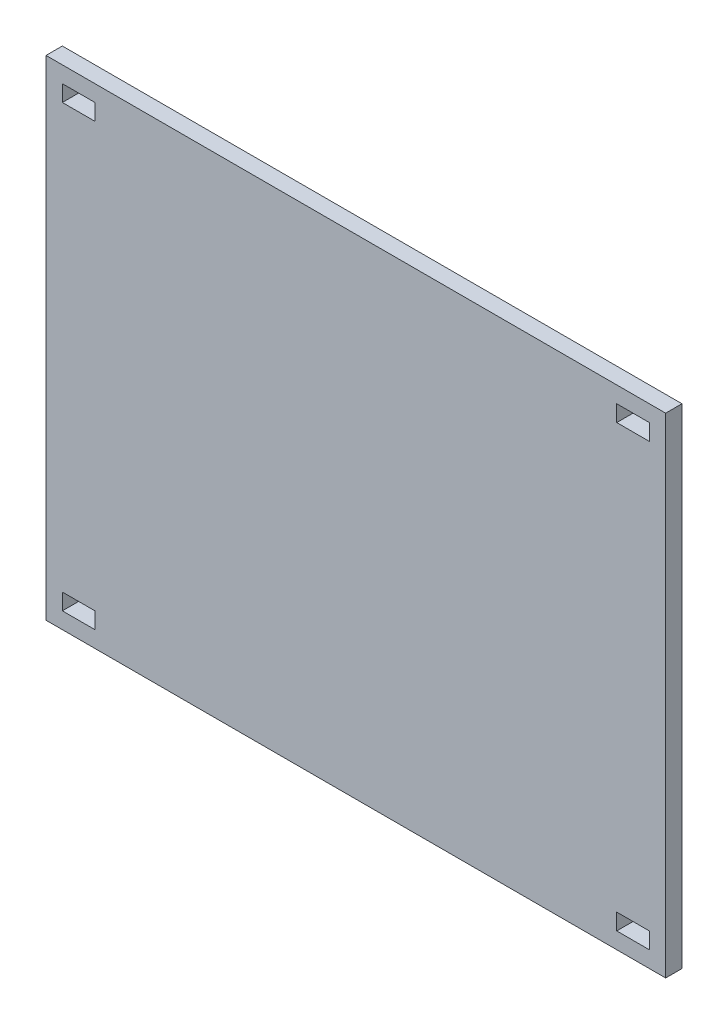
ISO-10303-21;
HEADER;
FILE_DESCRIPTION(('STEP AP214'),'2;1');
FILE_NAME('part.step','',(''),(''),'','','');
FILE_SCHEMA(('AUTOMOTIVE_DESIGN { 1 0 10303 214 1 1 1 1 }'));
ENDSEC;
DATA;
#1=APPLICATION_CONTEXT('core data for automotive mechanical design processes');
#2=APPLICATION_PROTOCOL_DEFINITION('international standard','automotive_design',2000,#1);
#3=PRODUCT_CONTEXT('',#1,'mechanical');
#4=PRODUCT('Part','Part','',(#3));
#5=PRODUCT_RELATED_PRODUCT_CATEGORY('part','',(#4));
#6=PRODUCT_DEFINITION_FORMATION('','',#4);
#7=PRODUCT_DEFINITION_CONTEXT('part definition',#1,'design');
#8=PRODUCT_DEFINITION('design','',#6,#7);
#9=PRODUCT_DEFINITION_SHAPE('','',#8);
#10=(LENGTH_UNIT() NAMED_UNIT(*) SI_UNIT(.MILLI.,.METRE.));
#11=(NAMED_UNIT(*) PLANE_ANGLE_UNIT() SI_UNIT($,.RADIAN.));
#12=(NAMED_UNIT(*) SI_UNIT($,.STERADIAN.) SOLID_ANGLE_UNIT());
#13=UNCERTAINTY_MEASURE_WITH_UNIT(LENGTH_MEASURE(1.E-05),#10,'distance_accuracy_value','');
#14=(GEOMETRIC_REPRESENTATION_CONTEXT(3) GLOBAL_UNCERTAINTY_ASSIGNED_CONTEXT((#13)) GLOBAL_UNIT_ASSIGNED_CONTEXT((#10,
#11,#12)) REPRESENTATION_CONTEXT('',''));
#15=CARTESIAN_POINT('',(0.,0.,0.));
#16=DIRECTION('',(0.,0.,1.));
#17=DIRECTION('',(1.,0.,0.));
#18=AXIS2_PLACEMENT_3D('',#15,#16,#17);
#19=CARTESIAN_POINT('',(0.,0.,3.175));
#20=DIRECTION('',(0.,0.,-1.));
#21=DIRECTION('',(-1.,0.,0.));
#22=AXIS2_PLACEMENT_3D('',#19,#20,#21);
#23=PLANE('',#22);
#24=DIRECTION('',(1.,0.,0.));
#25=VECTOR('',#24,1.);
#26=CARTESIAN_POINT('',(117.475,3.175,3.175));
#27=LINE('',#26,#25);
#28=CARTESIAN_POINT('',(111.125,3.175,3.175));
#29=VERTEX_POINT('',#28);
#30=CARTESIAN_POINT('',(117.475,3.175,3.175));
#31=VERTEX_POINT('',#30);
#32=EDGE_CURVE('E207',#29,#31,#27,.T.);
#33=ORIENTED_EDGE('',*,*,#32,.F.);
#34=DIRECTION('',(0.,-1.,0.));
#35=VECTOR('',#34,1.);
#36=CARTESIAN_POINT('',(111.125,3.175,3.175));
#37=LINE('',#36,#35);
#38=CARTESIAN_POINT('',(111.125,6.34999999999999,3.175));
#39=VERTEX_POINT('',#38);
#40=EDGE_CURVE('E215',#39,#29,#37,.T.);
#41=ORIENTED_EDGE('',*,*,#40,.F.);
#42=DIRECTION('',(-1.,0.,0.));
#43=VECTOR('',#42,1.);
#44=CARTESIAN_POINT('',(117.475,6.34999999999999,3.175));
#45=LINE('',#44,#43);
#46=CARTESIAN_POINT('',(117.475,6.34999999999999,3.175));
#47=VERTEX_POINT('',#46);
#48=EDGE_CURVE('E212',#47,#39,#45,.T.);
#49=ORIENTED_EDGE('',*,*,#48,.F.);
#50=DIRECTION('',(0.,1.,0.));
#51=VECTOR('',#50,1.);
#52=CARTESIAN_POINT('',(117.475,3.175,3.175));
#53=LINE('',#52,#51);
#54=EDGE_CURVE('E209',#31,#47,#53,.T.);
#55=ORIENTED_EDGE('',*,*,#54,.F.);
#56=EDGE_LOOP('',(#33,#41,#49,#55));
#57=FACE_BOUND('',#56,.T.);
#58=DIRECTION('',(0.,-1.,0.));
#59=VECTOR('',#58,1.);
#60=CARTESIAN_POINT('',(3.175,92.075,3.175));
#61=LINE('',#60,#59);
#62=CARTESIAN_POINT('',(3.175,92.075,3.175));
#63=VERTEX_POINT('',#62);
#64=CARTESIAN_POINT('',(3.175,88.9,3.175));
#65=VERTEX_POINT('',#64);
#66=EDGE_CURVE('E269',#63,#65,#61,.T.);
#67=ORIENTED_EDGE('',*,*,#66,.F.);
#68=DIRECTION('',(-1.,0.,0.));
#69=VECTOR('',#68,1.);
#70=CARTESIAN_POINT('',(3.175,92.075,3.175));
#71=LINE('',#70,#69);
#72=CARTESIAN_POINT('',(9.525,92.075,3.175));
#73=VERTEX_POINT('',#72);
#74=EDGE_CURVE('E277',#73,#63,#71,.T.);
#75=ORIENTED_EDGE('',*,*,#74,.F.);
#76=DIRECTION('',(0.,1.,0.));
#77=VECTOR('',#76,1.);
#78=CARTESIAN_POINT('',(9.525,92.075,3.175));
#79=LINE('',#78,#77);
#80=CARTESIAN_POINT('',(9.525,88.9,3.175));
#81=VERTEX_POINT('',#80);
#82=EDGE_CURVE('E274',#81,#73,#79,.T.);
#83=ORIENTED_EDGE('',*,*,#82,.F.);
#84=DIRECTION('',(1.,0.,0.));
#85=VECTOR('',#84,1.);
#86=CARTESIAN_POINT('',(3.175,88.9,3.175));
#87=LINE('',#86,#85);
#88=EDGE_CURVE('E271',#65,#81,#87,.T.);
#89=ORIENTED_EDGE('',*,*,#88,.F.);
#90=EDGE_LOOP('',(#67,#75,#83,#89));
#91=FACE_BOUND('',#90,.T.);
#92=DIRECTION('',(0.,-1.,0.));
#93=VECTOR('',#92,1.);
#94=CARTESIAN_POINT('',(0.,0.,3.175));
#95=LINE('',#94,#93);
#96=CARTESIAN_POINT('',(0.,95.25,3.175));
#97=VERTEX_POINT('',#96);
#98=CARTESIAN_POINT('',(0.,0.,3.175));
#99=VERTEX_POINT('',#98);
#100=EDGE_CURVE('E300',#97,#99,#95,.T.);
#101=ORIENTED_EDGE('',*,*,#100,.T.);
#102=DIRECTION('',(1.,0.,0.));
#103=VECTOR('',#102,1.);
#104=CARTESIAN_POINT('',(0.,0.,3.175));
#105=LINE('',#104,#103);
#106=CARTESIAN_POINT('',(120.65,0.,3.175));
#107=VERTEX_POINT('',#106);
#108=EDGE_CURVE('E303',#99,#107,#105,.T.);
#109=ORIENTED_EDGE('',*,*,#108,.T.);
#110=DIRECTION('',(0.,1.,0.));
#111=VECTOR('',#110,1.);
#112=CARTESIAN_POINT('',(120.65,0.,3.175));
#113=LINE('',#112,#111);
#114=CARTESIAN_POINT('',(120.65,95.25,3.175));
#115=VERTEX_POINT('',#114);
#116=EDGE_CURVE('E306',#107,#115,#113,.T.);
#117=ORIENTED_EDGE('',*,*,#116,.T.);
#118=DIRECTION('',(-1.,0.,0.));
#119=VECTOR('',#118,1.);
#120=CARTESIAN_POINT('',(0.,95.25,3.175));
#121=LINE('',#120,#119);
#122=EDGE_CURVE('E308',#115,#97,#121,.T.);
#123=ORIENTED_EDGE('',*,*,#122,.T.);
#124=EDGE_LOOP('',(#101,#109,#117,#123));
#125=FACE_BOUND('',#124,.T.);
#126=DIRECTION('',(1.,0.,0.));
#127=VECTOR('',#126,1.);
#128=CARTESIAN_POINT('',(3.175,3.175,3.175));
#129=LINE('',#128,#127);
#130=CARTESIAN_POINT('',(3.175,3.175,3.175));
#131=VERTEX_POINT('',#130);
#132=CARTESIAN_POINT('',(9.52499999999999,3.175,3.175));
#133=VERTEX_POINT('',#132);
#134=EDGE_CURVE('E238',#131,#133,#129,.T.);
#135=ORIENTED_EDGE('',*,*,#134,.F.);
#136=DIRECTION('',(0.,-1.,0.));
#137=VECTOR('',#136,1.);
#138=CARTESIAN_POINT('',(3.175,3.175,3.175));
#139=LINE('',#138,#137);
#140=CARTESIAN_POINT('',(3.175,6.34999999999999,3.175));
#141=VERTEX_POINT('',#140);
#142=EDGE_CURVE('E246',#141,#131,#139,.T.);
#143=ORIENTED_EDGE('',*,*,#142,.F.);
#144=DIRECTION('',(-1.,0.,0.));
#145=VECTOR('',#144,1.);
#146=CARTESIAN_POINT('',(3.175,6.34999999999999,3.175));
#147=LINE('',#146,#145);
#148=CARTESIAN_POINT('',(9.52499999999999,6.34999999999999,3.175));
#149=VERTEX_POINT('',#148);
#150=EDGE_CURVE('E243',#149,#141,#147,.T.);
#151=ORIENTED_EDGE('',*,*,#150,.F.);
#152=DIRECTION('',(0.,1.,0.));
#153=VECTOR('',#152,1.);
#154=CARTESIAN_POINT('',(9.52499999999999,3.175,3.175));
#155=LINE('',#154,#153);
#156=EDGE_CURVE('E240',#133,#149,#155,.T.);
#157=ORIENTED_EDGE('',*,*,#156,.F.);
#158=EDGE_LOOP('',(#135,#143,#151,#157));
#159=FACE_BOUND('',#158,.T.);
#160=DIRECTION('',(-1.,0.,0.));
#161=VECTOR('',#160,1.);
#162=CARTESIAN_POINT('',(117.475,92.075,3.175));
#163=LINE('',#162,#161);
#164=CARTESIAN_POINT('',(117.475,92.075,3.175));
#165=VERTEX_POINT('',#164);
#166=CARTESIAN_POINT('',(111.125,92.075,3.175));
#167=VERTEX_POINT('',#166);
#168=EDGE_CURVE('E171',#165,#167,#163,.T.);
#169=ORIENTED_EDGE('',*,*,#168,.F.);
#170=DIRECTION('',(0.,1.,0.));
#171=VECTOR('',#170,1.);
#172=CARTESIAN_POINT('',(117.475,92.075,3.175));
#173=LINE('',#172,#171);
#174=CARTESIAN_POINT('',(117.475,88.9,3.175));
#175=VERTEX_POINT('',#174);
#176=EDGE_CURVE('E193',#175,#165,#173,.T.);
#177=ORIENTED_EDGE('',*,*,#176,.F.);
#178=DIRECTION('',(1.,0.,0.));
#179=VECTOR('',#178,1.);
#180=CARTESIAN_POINT('',(117.475,88.9,3.175));
#181=LINE('',#180,#179);
#182=CARTESIAN_POINT('',(111.125,88.9,3.175));
#183=VERTEX_POINT('',#182);
#184=EDGE_CURVE('E191',#183,#175,#181,.T.);
#185=ORIENTED_EDGE('',*,*,#184,.F.);
#186=DIRECTION('',(0.,-1.,0.));
#187=VECTOR('',#186,1.);
#188=CARTESIAN_POINT('',(111.125,92.075,3.175));
#189=LINE('',#188,#187);
#190=EDGE_CURVE('E179',#167,#183,#189,.T.);
#191=ORIENTED_EDGE('',*,*,#190,.F.);
#192=EDGE_LOOP('',(#169,#177,#185,#191));
#193=FACE_BOUND('',#192,.T.);
#194=ADVANCED_FACE('F34',(#57,#91,#125,#159,#193),#23,.F.);
#195=CARTESIAN_POINT('',(0.,0.,0.));
#196=DIRECTION('',(0.,0.,-1.));
#197=DIRECTION('',(-1.,0.,0.));
#198=AXIS2_PLACEMENT_3D('',#195,#196,#197);
#199=PLANE('',#198);
#200=DIRECTION('',(0.,-1.,0.));
#201=VECTOR('',#200,1.);
#202=CARTESIAN_POINT('',(111.125,3.175,0.));
#203=LINE('',#202,#201);
#204=CARTESIAN_POINT('',(111.125,6.34999999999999,0.));
#205=VERTEX_POINT('',#204);
#206=CARTESIAN_POINT('',(111.125,3.175,0.));
#207=VERTEX_POINT('',#206);
#208=EDGE_CURVE('E210',#205,#207,#203,.T.);
#209=ORIENTED_EDGE('',*,*,#208,.T.);
#210=DIRECTION('',(1.,0.,0.));
#211=VECTOR('',#210,1.);
#212=CARTESIAN_POINT('',(117.475,3.175,0.));
#213=LINE('',#212,#211);
#214=CARTESIAN_POINT('',(117.475,3.175,0.));
#215=VERTEX_POINT('',#214);
#216=EDGE_CURVE('E187',#207,#215,#213,.T.);
#217=ORIENTED_EDGE('',*,*,#216,.T.);
#218=DIRECTION('',(0.,1.,0.));
#219=VECTOR('',#218,1.);
#220=CARTESIAN_POINT('',(117.475,3.175,0.));
#221=LINE('',#220,#219);
#222=CARTESIAN_POINT('',(117.475,6.34999999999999,0.));
#223=VERTEX_POINT('',#222);
#224=EDGE_CURVE('E220',#215,#223,#221,.T.);
#225=ORIENTED_EDGE('',*,*,#224,.T.);
#226=DIRECTION('',(-1.,0.,0.));
#227=VECTOR('',#226,1.);
#228=CARTESIAN_POINT('',(117.475,6.34999999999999,0.));
#229=LINE('',#228,#227);
#230=EDGE_CURVE('E223',#223,#205,#229,.T.);
#231=ORIENTED_EDGE('',*,*,#230,.T.);
#232=EDGE_LOOP('',(#209,#217,#225,#231));
#233=FACE_BOUND('',#232,.T.);
#234=DIRECTION('',(-1.,0.,0.));
#235=VECTOR('',#234,1.);
#236=CARTESIAN_POINT('',(3.175,92.075,0.));
#237=LINE('',#236,#235);
#238=CARTESIAN_POINT('',(9.525,92.075,0.));
#239=VERTEX_POINT('',#238);
#240=CARTESIAN_POINT('',(3.175,92.075,0.));
#241=VERTEX_POINT('',#240);
#242=EDGE_CURVE('E272',#239,#241,#237,.T.);
#243=ORIENTED_EDGE('',*,*,#242,.T.);
#244=DIRECTION('',(0.,-1.,0.));
#245=VECTOR('',#244,1.);
#246=CARTESIAN_POINT('',(3.175,92.075,0.));
#247=LINE('',#246,#245);
#248=CARTESIAN_POINT('',(3.175,88.9,0.));
#249=VERTEX_POINT('',#248);
#250=EDGE_CURVE('E268',#241,#249,#247,.T.);
#251=ORIENTED_EDGE('',*,*,#250,.T.);
#252=DIRECTION('',(1.,0.,0.));
#253=VECTOR('',#252,1.);
#254=CARTESIAN_POINT('',(3.175,88.9,0.));
#255=LINE('',#254,#253);
#256=CARTESIAN_POINT('',(9.525,88.9,0.));
#257=VERTEX_POINT('',#256);
#258=EDGE_CURVE('E282',#249,#257,#255,.T.);
#259=ORIENTED_EDGE('',*,*,#258,.T.);
#260=DIRECTION('',(0.,1.,0.));
#261=VECTOR('',#260,1.);
#262=CARTESIAN_POINT('',(9.525,92.075,0.));
#263=LINE('',#262,#261);
#264=EDGE_CURVE('E285',#257,#239,#263,.T.);
#265=ORIENTED_EDGE('',*,*,#264,.T.);
#266=EDGE_LOOP('',(#243,#251,#259,#265));
#267=FACE_BOUND('',#266,.T.);
#268=DIRECTION('',(0.,-1.,0.));
#269=VECTOR('',#268,1.);
#270=CARTESIAN_POINT('',(0.,0.,0.));
#271=LINE('',#270,#269);
#272=CARTESIAN_POINT('',(0.,95.25,0.));
#273=VERTEX_POINT('',#272);
#274=CARTESIAN_POINT('',(0.,0.,0.));
#275=VERTEX_POINT('',#274);
#276=EDGE_CURVE('E299',#273,#275,#271,.T.);
#277=ORIENTED_EDGE('',*,*,#276,.F.);
#278=DIRECTION('',(-1.,0.,0.));
#279=VECTOR('',#278,1.);
#280=CARTESIAN_POINT('',(0.,95.25,0.));
#281=LINE('',#280,#279);
#282=CARTESIAN_POINT('',(120.65,95.25,0.));
#283=VERTEX_POINT('',#282);
#284=EDGE_CURVE('E304',#283,#273,#281,.T.);
#285=ORIENTED_EDGE('',*,*,#284,.F.);
#286=DIRECTION('',(0.,1.,0.));
#287=VECTOR('',#286,1.);
#288=CARTESIAN_POINT('',(120.65,0.,0.));
#289=LINE('',#288,#287);
#290=CARTESIAN_POINT('',(120.65,0.,0.));
#291=VERTEX_POINT('',#290);
#292=EDGE_CURVE('E315',#291,#283,#289,.T.);
#293=ORIENTED_EDGE('',*,*,#292,.F.);
#294=DIRECTION('',(1.,0.,0.));
#295=VECTOR('',#294,1.);
#296=CARTESIAN_POINT('',(0.,0.,0.));
#297=LINE('',#296,#295);
#298=EDGE_CURVE('E313',#275,#291,#297,.T.);
#299=ORIENTED_EDGE('',*,*,#298,.F.);
#300=EDGE_LOOP('',(#277,#285,#293,#299));
#301=FACE_BOUND('',#300,.T.);
#302=DIRECTION('',(0.,-1.,0.));
#303=VECTOR('',#302,1.);
#304=CARTESIAN_POINT('',(3.175,3.175,0.));
#305=LINE('',#304,#303);
#306=CARTESIAN_POINT('',(3.175,6.34999999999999,0.));
#307=VERTEX_POINT('',#306);
#308=CARTESIAN_POINT('',(3.175,3.175,0.));
#309=VERTEX_POINT('',#308);
#310=EDGE_CURVE('E241',#307,#309,#305,.T.);
#311=ORIENTED_EDGE('',*,*,#310,.T.);
#312=DIRECTION('',(1.,0.,0.));
#313=VECTOR('',#312,1.);
#314=CARTESIAN_POINT('',(3.175,3.175,0.));
#315=LINE('',#314,#313);
#316=CARTESIAN_POINT('',(9.52499999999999,3.175,0.));
#317=VERTEX_POINT('',#316);
#318=EDGE_CURVE('E237',#309,#317,#315,.T.);
#319=ORIENTED_EDGE('',*,*,#318,.T.);
#320=DIRECTION('',(0.,1.,0.));
#321=VECTOR('',#320,1.);
#322=CARTESIAN_POINT('',(9.52499999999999,3.175,0.));
#323=LINE('',#322,#321);
#324=CARTESIAN_POINT('',(9.52499999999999,6.34999999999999,0.));
#325=VERTEX_POINT('',#324);
#326=EDGE_CURVE('E251',#317,#325,#323,.T.);
#327=ORIENTED_EDGE('',*,*,#326,.T.);
#328=DIRECTION('',(-1.,0.,0.));
#329=VECTOR('',#328,1.);
#330=CARTESIAN_POINT('',(3.175,6.34999999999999,0.));
#331=LINE('',#330,#329);
#332=EDGE_CURVE('E254',#325,#307,#331,.T.);
#333=ORIENTED_EDGE('',*,*,#332,.T.);
#334=EDGE_LOOP('',(#311,#319,#327,#333));
#335=FACE_BOUND('',#334,.T.);
#336=DIRECTION('',(0.,1.,0.));
#337=VECTOR('',#336,1.);
#338=CARTESIAN_POINT('',(117.475,92.075,0.));
#339=LINE('',#338,#337);
#340=CARTESIAN_POINT('',(117.475,88.9,0.));
#341=VERTEX_POINT('',#340);
#342=CARTESIAN_POINT('',(117.475,92.075,0.));
#343=VERTEX_POINT('',#342);
#344=EDGE_CURVE('E180',#341,#343,#339,.T.);
#345=ORIENTED_EDGE('',*,*,#344,.T.);
#346=DIRECTION('',(-1.,0.,0.));
#347=VECTOR('',#346,1.);
#348=CARTESIAN_POINT('',(117.475,92.075,0.));
#349=LINE('',#348,#347);
#350=CARTESIAN_POINT('',(111.125,92.075,0.));
#351=VERTEX_POINT('',#350);
#352=EDGE_CURVE('E57',#343,#351,#349,.T.);
#353=ORIENTED_EDGE('',*,*,#352,.T.);
#354=DIRECTION('',(0.,-1.,0.));
#355=VECTOR('',#354,1.);
#356=CARTESIAN_POINT('',(111.125,92.075,0.));
#357=LINE('',#356,#355);
#358=CARTESIAN_POINT('',(111.125,88.9,0.));
#359=VERTEX_POINT('',#358);
#360=EDGE_CURVE('E186',#351,#359,#357,.T.);
#361=ORIENTED_EDGE('',*,*,#360,.T.);
#362=DIRECTION('',(1.,0.,0.));
#363=VECTOR('',#362,1.);
#364=CARTESIAN_POINT('',(117.475,88.9,0.));
#365=LINE('',#364,#363);
#366=EDGE_CURVE('E199',#359,#341,#365,.T.);
#367=ORIENTED_EDGE('',*,*,#366,.T.);
#368=EDGE_LOOP('',(#345,#353,#361,#367));
#369=FACE_BOUND('',#368,.T.);
#370=ADVANCED_FACE('F333',(#233,#267,#301,#335,#369),#199,.T.);
#371=CARTESIAN_POINT('',(0.,0.,3.175));
#372=DIRECTION('',(1.,0.,0.));
#373=DIRECTION('',(0.,0.,-1.));
#374=AXIS2_PLACEMENT_3D('',#371,#372,#373);
#375=PLANE('',#374);
#376=ORIENTED_EDGE('',*,*,#276,.T.);
#377=DIRECTION('',(0.,0.,-1.));
#378=VECTOR('',#377,1.);
#379=CARTESIAN_POINT('',(0.,0.,3.175));
#380=LINE('',#379,#378);
#381=EDGE_CURVE('E11',#99,#275,#380,.T.);
#382=ORIENTED_EDGE('',*,*,#381,.F.);
#383=ORIENTED_EDGE('',*,*,#100,.F.);
#384=DIRECTION('',(0.,0.,-1.));
#385=VECTOR('',#384,1.);
#386=CARTESIAN_POINT('',(0.,95.25,3.175));
#387=LINE('',#386,#385);
#388=EDGE_CURVE('E310',#97,#273,#387,.T.);
#389=ORIENTED_EDGE('',*,*,#388,.T.);
#390=EDGE_LOOP('',(#376,#382,#383,#389));
#391=FACE_BOUND('',#390,.T.);
#392=ADVANCED_FACE('F36',(#391),#375,.F.);
#393=CARTESIAN_POINT('',(0.,0.,3.175));
#394=DIRECTION('',(0.,1.,0.));
#395=DIRECTION('',(0.,0.,1.));
#396=AXIS2_PLACEMENT_3D('',#393,#394,#395);
#397=PLANE('',#396);
#398=ORIENTED_EDGE('',*,*,#298,.T.);
#399=DIRECTION('',(0.,0.,-1.));
#400=VECTOR('',#399,1.);
#401=CARTESIAN_POINT('',(120.65,0.,3.175));
#402=LINE('',#401,#400);
#403=EDGE_CURVE('E42',#107,#291,#402,.T.);
#404=ORIENTED_EDGE('',*,*,#403,.F.);
#405=ORIENTED_EDGE('',*,*,#108,.F.);
#406=ORIENTED_EDGE('',*,*,#381,.T.);
#407=EDGE_LOOP('',(#398,#404,#405,#406));
#408=FACE_BOUND('',#407,.T.);
#409=ADVANCED_FACE('F344',(#408),#397,.F.);
#410=CARTESIAN_POINT('',(120.65,0.,3.175));
#411=DIRECTION('',(-1.,0.,0.));
#412=DIRECTION('',(0.,0.,1.));
#413=AXIS2_PLACEMENT_3D('',#410,#411,#412);
#414=PLANE('',#413);
#415=ORIENTED_EDGE('',*,*,#292,.T.);
#416=DIRECTION('',(0.,0.,-1.));
#417=VECTOR('',#416,1.);
#418=CARTESIAN_POINT('',(120.65,95.25,3.175));
#419=LINE('',#418,#417);
#420=EDGE_CURVE('E320',#115,#283,#419,.T.);
#421=ORIENTED_EDGE('',*,*,#420,.F.);
#422=ORIENTED_EDGE('',*,*,#116,.F.);
#423=ORIENTED_EDGE('',*,*,#403,.T.);
#424=EDGE_LOOP('',(#415,#421,#422,#423));
#425=FACE_BOUND('',#424,.T.);
#426=ADVANCED_FACE('F327',(#425),#414,.F.);
#427=CARTESIAN_POINT('',(0.,95.25,3.175));
#428=DIRECTION('',(0.,-1.,0.));
#429=DIRECTION('',(0.,0.,-1.));
#430=AXIS2_PLACEMENT_3D('',#427,#428,#429);
#431=PLANE('',#430);
#432=ORIENTED_EDGE('',*,*,#284,.T.);
#433=ORIENTED_EDGE('',*,*,#388,.F.);
#434=ORIENTED_EDGE('',*,*,#122,.F.);
#435=ORIENTED_EDGE('',*,*,#420,.T.);
#436=EDGE_LOOP('',(#432,#433,#434,#435));
#437=FACE_BOUND('',#436,.T.);
#438=ADVANCED_FACE('F337',(#437),#431,.F.);
#439=CARTESIAN_POINT('',(3.175,92.075,3.175));
#440=DIRECTION('',(1.,0.,0.));
#441=DIRECTION('',(0.,1.,0.));
#442=AXIS2_PLACEMENT_3D('',#439,#440,#441);
#443=PLANE('',#442);
#444=ORIENTED_EDGE('',*,*,#250,.F.);
#445=DIRECTION('',(0.,0.,-1.));
#446=VECTOR('',#445,1.);
#447=CARTESIAN_POINT('',(3.175,92.075,3.175));
#448=LINE('',#447,#446);
#449=EDGE_CURVE('E279',#63,#241,#448,.T.);
#450=ORIENTED_EDGE('',*,*,#449,.F.);
#451=ORIENTED_EDGE('',*,*,#66,.T.);
#452=DIRECTION('',(0.,0.,-1.));
#453=VECTOR('',#452,1.);
#454=CARTESIAN_POINT('',(3.175,88.9,3.175));
#455=LINE('',#454,#453);
#456=EDGE_CURVE('E296',#65,#249,#455,.T.);
#457=ORIENTED_EDGE('',*,*,#456,.T.);
#458=EDGE_LOOP('',(#444,#450,#451,#457));
#459=FACE_BOUND('',#458,.T.);
#460=ADVANCED_FACE('F362',(#459),#443,.T.);
#461=CARTESIAN_POINT('',(3.175,88.9,3.175));
#462=DIRECTION('',(0.,1.,0.));
#463=DIRECTION('',(0.,0.,1.));
#464=AXIS2_PLACEMENT_3D('',#461,#462,#463);
#465=PLANE('',#464);
#466=ORIENTED_EDGE('',*,*,#258,.F.);
#467=ORIENTED_EDGE('',*,*,#456,.F.);
#468=ORIENTED_EDGE('',*,*,#88,.T.);
#469=DIRECTION('',(0.,0.,-1.));
#470=VECTOR('',#469,1.);
#471=CARTESIAN_POINT('',(9.525,88.9,3.175));
#472=LINE('',#471,#470);
#473=EDGE_CURVE('E294',#81,#257,#472,.T.);
#474=ORIENTED_EDGE('',*,*,#473,.T.);
#475=EDGE_LOOP('',(#466,#467,#468,#474));
#476=FACE_BOUND('',#475,.T.);
#477=ADVANCED_FACE('F369',(#476),#465,.T.);
#478=CARTESIAN_POINT('',(9.525,92.075,3.175));
#479=DIRECTION('',(-1.,0.,0.));
#480=DIRECTION('',(0.,0.,1.));
#481=AXIS2_PLACEMENT_3D('',#478,#479,#480);
#482=PLANE('',#481);
#483=ORIENTED_EDGE('',*,*,#264,.F.);
#484=ORIENTED_EDGE('',*,*,#473,.F.);
#485=ORIENTED_EDGE('',*,*,#82,.T.);
#486=DIRECTION('',(0.,0.,-1.));
#487=VECTOR('',#486,1.);
#488=CARTESIAN_POINT('',(9.525,92.075,3.175));
#489=LINE('',#488,#487);
#490=EDGE_CURVE('E292',#73,#239,#489,.T.);
#491=ORIENTED_EDGE('',*,*,#490,.T.);
#492=EDGE_LOOP('',(#483,#484,#485,#491));
#493=FACE_BOUND('',#492,.T.);
#494=ADVANCED_FACE('F374',(#493),#482,.T.);
#495=CARTESIAN_POINT('',(3.175,92.075,3.175));
#496=DIRECTION('',(0.,-1.,0.));
#497=DIRECTION('',(0.,0.,-1.));
#498=AXIS2_PLACEMENT_3D('',#495,#496,#497);
#499=PLANE('',#498);
#500=ORIENTED_EDGE('',*,*,#242,.F.);
#501=ORIENTED_EDGE('',*,*,#490,.F.);
#502=ORIENTED_EDGE('',*,*,#74,.T.);
#503=ORIENTED_EDGE('',*,*,#449,.T.);
#504=EDGE_LOOP('',(#500,#501,#502,#503));
#505=FACE_BOUND('',#504,.T.);
#506=ADVANCED_FACE('F382',(#505),#499,.T.);
#507=CARTESIAN_POINT('',(3.175,3.175,3.175));
#508=DIRECTION('',(0.,1.,0.));
#509=DIRECTION('',(0.,0.,1.));
#510=AXIS2_PLACEMENT_3D('',#507,#508,#509);
#511=PLANE('',#510);
#512=ORIENTED_EDGE('',*,*,#318,.F.);
#513=DIRECTION('',(0.,0.,-1.));
#514=VECTOR('',#513,1.);
#515=CARTESIAN_POINT('',(3.175,3.175,3.175));
#516=LINE('',#515,#514);
#517=EDGE_CURVE('E248',#131,#309,#516,.T.);
#518=ORIENTED_EDGE('',*,*,#517,.F.);
#519=ORIENTED_EDGE('',*,*,#134,.T.);
#520=DIRECTION('',(0.,0.,-1.));
#521=VECTOR('',#520,1.);
#522=CARTESIAN_POINT('',(9.52499999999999,3.175,3.175));
#523=LINE('',#522,#521);
#524=EDGE_CURVE('E265',#133,#317,#523,.T.);
#525=ORIENTED_EDGE('',*,*,#524,.T.);
#526=EDGE_LOOP('',(#512,#518,#519,#525));
#527=FACE_BOUND('',#526,.T.);
#528=ADVANCED_FACE('F394',(#527),#511,.T.);
#529=CARTESIAN_POINT('',(9.52499999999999,3.175,3.175));
#530=DIRECTION('',(-1.,0.,0.));
#531=DIRECTION('',(0.,0.,1.));
#532=AXIS2_PLACEMENT_3D('',#529,#530,#531);
#533=PLANE('',#532);
#534=ORIENTED_EDGE('',*,*,#326,.F.);
#535=ORIENTED_EDGE('',*,*,#524,.F.);
#536=ORIENTED_EDGE('',*,*,#156,.T.);
#537=DIRECTION('',(0.,0.,-1.));
#538=VECTOR('',#537,1.);
#539=CARTESIAN_POINT('',(9.52499999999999,6.34999999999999,3.175));
#540=LINE('',#539,#538);
#541=EDGE_CURVE('E263',#149,#325,#540,.T.);
#542=ORIENTED_EDGE('',*,*,#541,.T.);
#543=EDGE_LOOP('',(#534,#535,#536,#542));
#544=FACE_BOUND('',#543,.T.);
#545=ADVANCED_FACE('F399',(#544),#533,.T.);
#546=CARTESIAN_POINT('',(3.175,6.34999999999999,3.175));
#547=DIRECTION('',(0.,-1.,0.));
#548=DIRECTION('',(0.,0.,-1.));
#549=AXIS2_PLACEMENT_3D('',#546,#547,#548);
#550=PLANE('',#549);
#551=ORIENTED_EDGE('',*,*,#332,.F.);
#552=ORIENTED_EDGE('',*,*,#541,.F.);
#553=ORIENTED_EDGE('',*,*,#150,.T.);
#554=DIRECTION('',(0.,0.,-1.));
#555=VECTOR('',#554,1.);
#556=CARTESIAN_POINT('',(3.175,6.34999999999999,3.175));
#557=LINE('',#556,#555);
#558=EDGE_CURVE('E261',#141,#307,#557,.T.);
#559=ORIENTED_EDGE('',*,*,#558,.T.);
#560=EDGE_LOOP('',(#551,#552,#553,#559));
#561=FACE_BOUND('',#560,.T.);
#562=ADVANCED_FACE('F403',(#561),#550,.T.);
#563=CARTESIAN_POINT('',(3.175,3.175,3.175));
#564=DIRECTION('',(1.,0.,0.));
#565=DIRECTION('',(0.,1.,0.));
#566=AXIS2_PLACEMENT_3D('',#563,#564,#565);
#567=PLANE('',#566);
#568=ORIENTED_EDGE('',*,*,#310,.F.);
#569=ORIENTED_EDGE('',*,*,#558,.F.);
#570=ORIENTED_EDGE('',*,*,#142,.T.);
#571=ORIENTED_EDGE('',*,*,#517,.T.);
#572=EDGE_LOOP('',(#568,#569,#570,#571));
#573=FACE_BOUND('',#572,.T.);
#574=ADVANCED_FACE('F407',(#573),#567,.T.);
#575=CARTESIAN_POINT('',(117.475,3.175,3.175));
#576=DIRECTION('',(0.,1.,0.));
#577=DIRECTION('',(0.,0.,1.));
#578=AXIS2_PLACEMENT_3D('',#575,#576,#577);
#579=PLANE('',#578);
#580=ORIENTED_EDGE('',*,*,#216,.F.);
#581=DIRECTION('',(0.,0.,-1.));
#582=VECTOR('',#581,1.);
#583=CARTESIAN_POINT('',(111.125,3.175,3.175));
#584=LINE('',#583,#582);
#585=EDGE_CURVE('E217',#29,#207,#584,.T.);
#586=ORIENTED_EDGE('',*,*,#585,.F.);
#587=ORIENTED_EDGE('',*,*,#32,.T.);
#588=DIRECTION('',(0.,0.,-1.));
#589=VECTOR('',#588,1.);
#590=CARTESIAN_POINT('',(117.475,3.175,3.175));
#591=LINE('',#590,#589);
#592=EDGE_CURVE('E234',#31,#215,#591,.T.);
#593=ORIENTED_EDGE('',*,*,#592,.T.);
#594=EDGE_LOOP('',(#580,#586,#587,#593));
#595=FACE_BOUND('',#594,.T.);
#596=ADVANCED_FACE('F411',(#595),#579,.T.);
#597=CARTESIAN_POINT('',(117.475,3.175,3.175));
#598=DIRECTION('',(-1.,0.,0.));
#599=DIRECTION('',(0.,0.,1.));
#600=AXIS2_PLACEMENT_3D('',#597,#598,#599);
#601=PLANE('',#600);
#602=ORIENTED_EDGE('',*,*,#224,.F.);
#603=ORIENTED_EDGE('',*,*,#592,.F.);
#604=ORIENTED_EDGE('',*,*,#54,.T.);
#605=DIRECTION('',(0.,0.,-1.));
#606=VECTOR('',#605,1.);
#607=CARTESIAN_POINT('',(117.475,6.34999999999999,3.175));
#608=LINE('',#607,#606);
#609=EDGE_CURVE('E232',#47,#223,#608,.T.);
#610=ORIENTED_EDGE('',*,*,#609,.T.);
#611=EDGE_LOOP('',(#602,#603,#604,#610));
#612=FACE_BOUND('',#611,.T.);
#613=ADVANCED_FACE('F415',(#612),#601,.T.);
#614=CARTESIAN_POINT('',(117.475,6.34999999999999,3.175));
#615=DIRECTION('',(0.,-1.,0.));
#616=DIRECTION('',(0.,0.,-1.));
#617=AXIS2_PLACEMENT_3D('',#614,#615,#616);
#618=PLANE('',#617);
#619=ORIENTED_EDGE('',*,*,#230,.F.);
#620=ORIENTED_EDGE('',*,*,#609,.F.);
#621=ORIENTED_EDGE('',*,*,#48,.T.);
#622=DIRECTION('',(0.,0.,-1.));
#623=VECTOR('',#622,1.);
#624=CARTESIAN_POINT('',(111.125,6.34999999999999,3.175));
#625=LINE('',#624,#623);
#626=EDGE_CURVE('E230',#39,#205,#625,.T.);
#627=ORIENTED_EDGE('',*,*,#626,.T.);
#628=EDGE_LOOP('',(#619,#620,#621,#627));
#629=FACE_BOUND('',#628,.T.);
#630=ADVANCED_FACE('F419',(#629),#618,.T.);
#631=CARTESIAN_POINT('',(111.125,3.175,3.175));
#632=DIRECTION('',(1.,0.,0.));
#633=DIRECTION('',(0.,0.,-1.));
#634=AXIS2_PLACEMENT_3D('',#631,#632,#633);
#635=PLANE('',#634);
#636=ORIENTED_EDGE('',*,*,#208,.F.);
#637=ORIENTED_EDGE('',*,*,#626,.F.);
#638=ORIENTED_EDGE('',*,*,#40,.T.);
#639=ORIENTED_EDGE('',*,*,#585,.T.);
#640=EDGE_LOOP('',(#636,#637,#638,#639));
#641=FACE_BOUND('',#640,.T.);
#642=ADVANCED_FACE('F423',(#641),#635,.T.);
#643=CARTESIAN_POINT('',(117.475,92.075,3.175));
#644=DIRECTION('',(0.,-1.,0.));
#645=DIRECTION('',(0.,0.,-1.));
#646=AXIS2_PLACEMENT_3D('',#643,#644,#645);
#647=PLANE('',#646);
#648=ORIENTED_EDGE('',*,*,#352,.F.);
#649=DIRECTION('',(0.,0.,-1.));
#650=VECTOR('',#649,1.);
#651=CARTESIAN_POINT('',(117.475,92.075,3.175));
#652=LINE('',#651,#650);
#653=EDGE_CURVE('E175',#165,#343,#652,.T.);
#654=ORIENTED_EDGE('',*,*,#653,.F.);
#655=ORIENTED_EDGE('',*,*,#168,.T.);
#656=DIRECTION('',(0.,0.,-1.));
#657=VECTOR('',#656,1.);
#658=CARTESIAN_POINT('',(111.125,92.075,3.175));
#659=LINE('',#658,#657);
#660=EDGE_CURVE('E174',#167,#351,#659,.T.);
#661=ORIENTED_EDGE('',*,*,#660,.T.);
#662=EDGE_LOOP('',(#648,#654,#655,#661));
#663=FACE_BOUND('',#662,.T.);
#664=ADVANCED_FACE('F173',(#663),#647,.T.);
#665=CARTESIAN_POINT('',(111.125,92.075,3.175));
#666=DIRECTION('',(1.,0.,0.));
#667=DIRECTION('',(0.,0.,-1.));
#668=AXIS2_PLACEMENT_3D('',#665,#666,#667);
#669=PLANE('',#668);
#670=ORIENTED_EDGE('',*,*,#360,.F.);
#671=ORIENTED_EDGE('',*,*,#660,.F.);
#672=ORIENTED_EDGE('',*,*,#190,.T.);
#673=DIRECTION('',(0.,0.,-1.));
#674=VECTOR('',#673,1.);
#675=CARTESIAN_POINT('',(111.125,88.9,3.175));
#676=LINE('',#675,#674);
#677=EDGE_CURVE('E188',#183,#359,#676,.T.);
#678=ORIENTED_EDGE('',*,*,#677,.T.);
#679=EDGE_LOOP('',(#670,#671,#672,#678));
#680=FACE_BOUND('',#679,.T.);
#681=ADVANCED_FACE('F183',(#680),#669,.T.);
#682=CARTESIAN_POINT('',(117.475,88.9,3.175));
#683=DIRECTION('',(0.,1.,0.));
#684=DIRECTION('',(0.,0.,1.));
#685=AXIS2_PLACEMENT_3D('',#682,#683,#684);
#686=PLANE('',#685);
#687=ORIENTED_EDGE('',*,*,#366,.F.);
#688=ORIENTED_EDGE('',*,*,#677,.F.);
#689=ORIENTED_EDGE('',*,*,#184,.T.);
#690=DIRECTION('',(0.,0.,-1.));
#691=VECTOR('',#690,1.);
#692=CARTESIAN_POINT('',(117.475,88.9,3.175));
#693=LINE('',#692,#691);
#694=EDGE_CURVE('E49',#175,#341,#693,.T.);
#695=ORIENTED_EDGE('',*,*,#694,.T.);
#696=EDGE_LOOP('',(#687,#688,#689,#695));
#697=FACE_BOUND('',#696,.T.);
#698=ADVANCED_FACE('F432',(#697),#686,.T.);
#699=CARTESIAN_POINT('',(117.475,92.075,3.175));
#700=DIRECTION('',(-1.,0.,0.));
#701=DIRECTION('',(0.,0.,1.));
#702=AXIS2_PLACEMENT_3D('',#699,#700,#701);
#703=PLANE('',#702);
#704=ORIENTED_EDGE('',*,*,#344,.F.);
#705=ORIENTED_EDGE('',*,*,#694,.F.);
#706=ORIENTED_EDGE('',*,*,#176,.T.);
#707=ORIENTED_EDGE('',*,*,#653,.T.);
#708=EDGE_LOOP('',(#704,#705,#706,#707));
#709=FACE_BOUND('',#708,.T.);
#710=ADVANCED_FACE('F435',(#709),#703,.T.);
#711=CLOSED_SHELL('',(#194,#370,#392,#409,#426,#438,#460,#477,#494,#506,#528,#545,#562,#574,
#596,#613,#630,#642,#664,#681,#698,#710));
#712=MANIFOLD_SOLID_BREP('B2',#711);
#713=ADVANCED_BREP_SHAPE_REPRESENTATION('',(#18,#712),#14);
#714=SHAPE_DEFINITION_REPRESENTATION(#9,#713);
ENDSEC;
END-ISO-10303-21;
